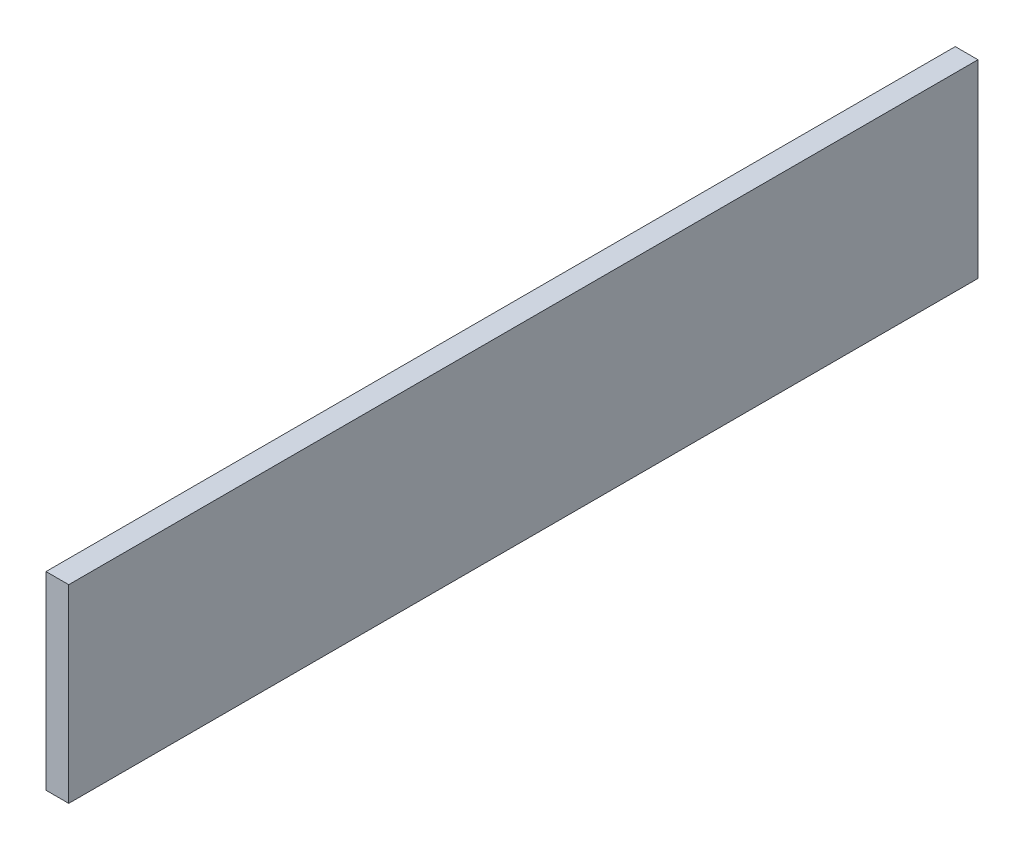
from build123d import *

# Parameters (mm, degrees)
BOSS_EXTRU_1_DEPTH      = 10
BOSS_EXTRU_1_DEPTH_BACK = 110
ESQUISSE1_W             = 3
ESQUISSE1_H             = 25


with BuildPart() as part:
    # Esquisse1 → Boss.-Extru.1 (new, two sides: drawn at the far end of the back side and taken through both)
    with BuildSketch(Plane.XY.offset(-BOSS_EXTRU_1_DEPTH_BACK)):
        with Locations((0, 107.5)):
            Rectangle(ESQUISSE1_W, ESQUISSE1_H)
    extrude(amount=BOSS_EXTRU_1_DEPTH + BOSS_EXTRU_1_DEPTH_BACK)


solid = part.part
